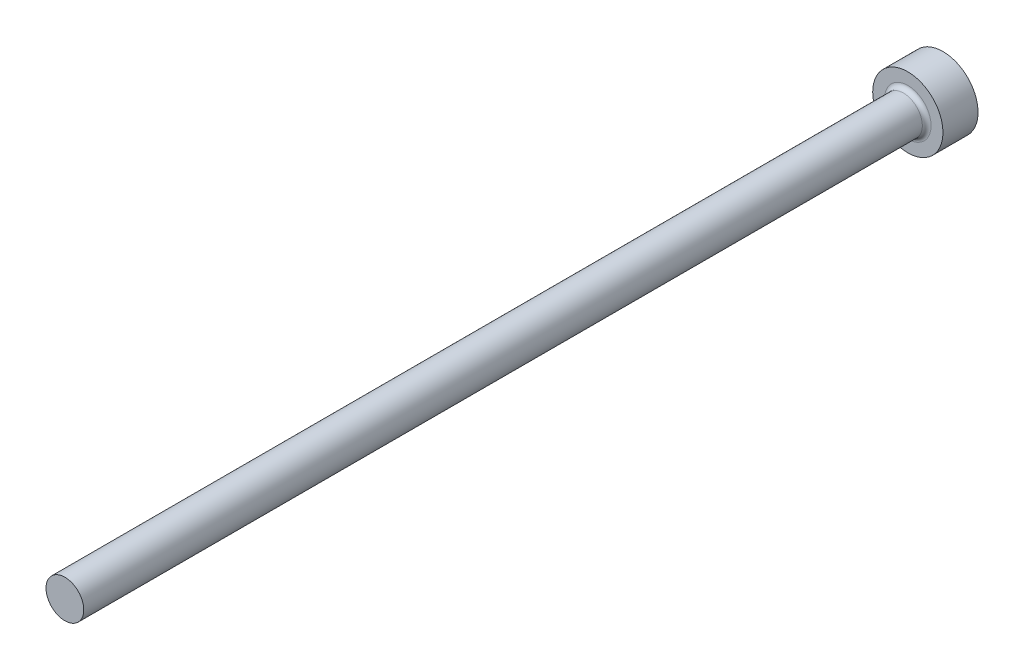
ISO-10303-21;
HEADER;
FILE_DESCRIPTION(('STEP AP214'),'2;1');
FILE_NAME('part.step','',(''),(''),'','','');
FILE_SCHEMA(('AUTOMOTIVE_DESIGN { 1 0 10303 214 1 1 1 1 }'));
ENDSEC;
DATA;
#1=APPLICATION_CONTEXT('core data for automotive mechanical design processes');
#2=APPLICATION_PROTOCOL_DEFINITION('international standard','automotive_design',2000,#1);
#3=PRODUCT_CONTEXT('',#1,'mechanical');
#4=PRODUCT('Part','Part','',(#3));
#5=PRODUCT_RELATED_PRODUCT_CATEGORY('part','',(#4));
#6=PRODUCT_DEFINITION_FORMATION('','',#4);
#7=PRODUCT_DEFINITION_CONTEXT('part definition',#1,'design');
#8=PRODUCT_DEFINITION('design','',#6,#7);
#9=PRODUCT_DEFINITION_SHAPE('','',#8);
#10=(LENGTH_UNIT() NAMED_UNIT(*) SI_UNIT(.MILLI.,.METRE.));
#11=(NAMED_UNIT(*) PLANE_ANGLE_UNIT() SI_UNIT($,.RADIAN.));
#12=(NAMED_UNIT(*) SI_UNIT($,.STERADIAN.) SOLID_ANGLE_UNIT());
#13=UNCERTAINTY_MEASURE_WITH_UNIT(LENGTH_MEASURE(1.E-05),#10,'distance_accuracy_value','');
#14=(GEOMETRIC_REPRESENTATION_CONTEXT(3) GLOBAL_UNCERTAINTY_ASSIGNED_CONTEXT((#13)) GLOBAL_UNIT_ASSIGNED_CONTEXT((#10,
#11,#12)) REPRESENTATION_CONTEXT('',''));
#15=CARTESIAN_POINT('',(0.,0.,0.));
#16=DIRECTION('',(0.,0.,1.));
#17=DIRECTION('',(1.,0.,0.));
#18=AXIS2_PLACEMENT_3D('',#15,#16,#17);
#19=CARTESIAN_POINT('',(4.,0.,4.));
#20=DIRECTION('',(0.,0.,-1.));
#21=DIRECTION('',(-1.,0.,0.));
#22=AXIS2_PLACEMENT_3D('',#19,#20,#21);
#23=PLANE('',#22);
#24=CARTESIAN_POINT('',(0.,0.,4.));
#25=DIRECTION('',(0.,0.,-1.));
#26=DIRECTION('',(-1.,0.,0.));
#27=AXIS2_PLACEMENT_3D('',#24,#25,#26);
#28=CIRCLE('',#27,2.65000000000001);
#29=CARTESIAN_POINT('',(-2.65000000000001,0.,4.));
#30=VERTEX_POINT('',#29);
#31=EDGE_CURVE('E40',#30,#30,#28,.T.);
#32=ORIENTED_EDGE('',*,*,#31,.T.);
#33=EDGE_LOOP('',(#32));
#34=FACE_BOUND('',#33,.T.);
#35=CARTESIAN_POINT('',(0.,0.,4.));
#36=DIRECTION('',(0.,0.,-1.));
#37=DIRECTION('',(-1.,0.,0.));
#38=AXIS2_PLACEMENT_3D('',#35,#36,#37);
#39=CIRCLE('',#38,4.);
#40=CARTESIAN_POINT('',(-4.,0.,4.));
#41=VERTEX_POINT('',#40);
#42=EDGE_CURVE('E44',#41,#41,#39,.T.);
#43=ORIENTED_EDGE('',*,*,#42,.F.);
#44=EDGE_LOOP('',(#43));
#45=FACE_BOUND('',#44,.T.);
#46=ADVANCED_FACE('F33',(#34,#45),#23,.F.);
#47=CARTESIAN_POINT('',(0.,0.,-9.03322817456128));
#48=DIRECTION('',(0.,0.,-1.));
#49=DIRECTION('',(-1.,0.,0.));
#50=AXIS2_PLACEMENT_3D('',#47,#48,#49);
#51=CYLINDRICAL_SURFACE('',#50,4.);
#52=CARTESIAN_POINT('',(0.,0.,0.));
#53=DIRECTION('',(0.,0.,-1.));
#54=DIRECTION('',(-1.,0.,0.));
#55=AXIS2_PLACEMENT_3D('',#52,#53,#54);
#56=CIRCLE('',#55,4.);
#57=CARTESIAN_POINT('',(-4.,0.,0.));
#58=VERTEX_POINT('',#57);
#59=EDGE_CURVE('E48',#58,#58,#56,.T.);
#60=ORIENTED_EDGE('',*,*,#59,.F.);
#61=EDGE_LOOP('',(#60));
#62=FACE_BOUND('',#61,.T.);
#63=ORIENTED_EDGE('',*,*,#42,.T.);
#64=EDGE_LOOP('',(#63));
#65=FACE_BOUND('',#64,.T.);
#66=ADVANCED_FACE('F68',(#62,#65),#51,.T.);
#67=CARTESIAN_POINT('',(0.,0.,0.));
#68=DIRECTION('',(0.,0.,1.));
#69=DIRECTION('',(1.,0.,0.));
#70=AXIS2_PLACEMENT_3D('',#67,#68,#69);
#71=PLANE('',#70);
#72=ORIENTED_EDGE('',*,*,#59,.T.);
#73=EDGE_LOOP('',(#72));
#74=FACE_BOUND('',#73,.T.);
#75=ADVANCED_FACE('F61',(#74),#71,.F.);
#76=CARTESIAN_POINT('',(0.,0.,100.));
#77=DIRECTION('',(0.,0.,-1.));
#78=DIRECTION('',(-1.,0.,0.));
#79=AXIS2_PLACEMENT_3D('',#76,#77,#78);
#80=PLANE('',#79);
#81=CARTESIAN_POINT('',(0.,0.,100.));
#82=DIRECTION('',(0.,0.,-1.));
#83=DIRECTION('',(-1.,0.,0.));
#84=AXIS2_PLACEMENT_3D('',#81,#82,#83);
#85=CIRCLE('',#84,2.15000000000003);
#86=CARTESIAN_POINT('',(-2.15000000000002,0.,100.));
#87=VERTEX_POINT('',#86);
#88=EDGE_CURVE('E53',#87,#87,#85,.T.);
#89=ORIENTED_EDGE('',*,*,#88,.F.);
#90=EDGE_LOOP('',(#89));
#91=FACE_BOUND('',#90,.T.);
#92=ADVANCED_FACE('F59',(#91),#80,.F.);
#93=CARTESIAN_POINT('',(0.,0.,-9.03322817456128));
#94=DIRECTION('',(0.,0.,-1.));
#95=DIRECTION('',(-1.,0.,0.));
#96=AXIS2_PLACEMENT_3D('',#93,#94,#95);
#97=CYLINDRICAL_SURFACE('',#96,2.15000000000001);
#98=CARTESIAN_POINT('',(0.,0.,4.5));
#99=DIRECTION('',(0.,0.,-1.));
#100=DIRECTION('',(-1.,0.,0.));
#101=AXIS2_PLACEMENT_3D('',#98,#99,#100);
#102=CIRCLE('',#101,2.15000000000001);
#103=CARTESIAN_POINT('',(-2.15000000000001,0.,4.5));
#104=VERTEX_POINT('',#103);
#105=EDGE_CURVE('E10',#104,#104,#102,.F.);
#106=ORIENTED_EDGE('',*,*,#105,.T.);
#107=EDGE_LOOP('',(#106));
#108=FACE_BOUND('',#107,.T.);
#109=ORIENTED_EDGE('',*,*,#88,.T.);
#110=EDGE_LOOP('',(#109));
#111=FACE_BOUND('',#110,.T.);
#112=ADVANCED_FACE('F57',(#108,#111),#97,.T.);
#113=CARTESIAN_POINT('',(0.,0.,4.5));
#114=DIRECTION('',(0.,0.,-1.));
#115=DIRECTION('',(-1.,0.,0.));
#116=AXIS2_PLACEMENT_3D('',#113,#114,#115);
#117=TOROIDAL_SURFACE('',#116,2.65000000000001,0.5);
#118=ORIENTED_EDGE('',*,*,#105,.F.);
#119=EDGE_LOOP('',(#118));
#120=FACE_BOUND('',#119,.T.);
#121=ORIENTED_EDGE('',*,*,#31,.F.);
#122=EDGE_LOOP('',(#121));
#123=FACE_BOUND('',#122,.T.);
#124=ADVANCED_FACE('F35',(#120,#123),#117,.F.);
#125=CLOSED_SHELL('',(#46,#66,#75,#92,#112,#124));
#126=MANIFOLD_SOLID_BREP('B2',#125);
#127=ADVANCED_BREP_SHAPE_REPRESENTATION('',(#18,#126),#14);
#128=SHAPE_DEFINITION_REPRESENTATION(#9,#127);
ENDSEC;
END-ISO-10303-21;
